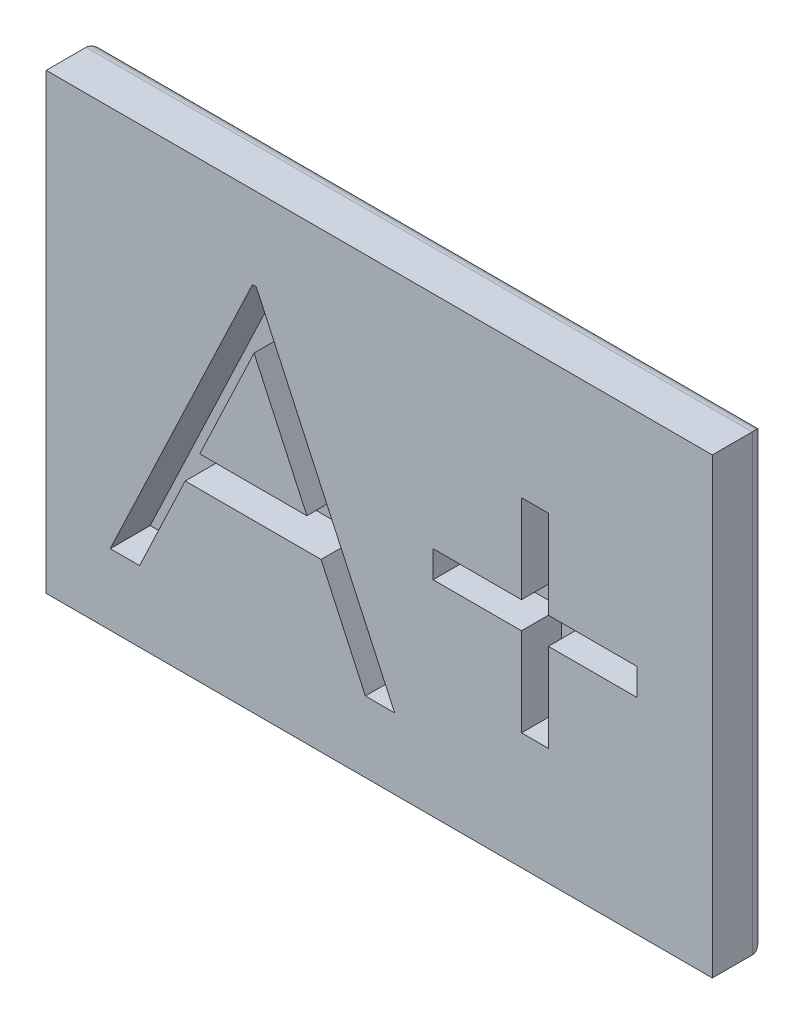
ISO-10303-21;
HEADER;
FILE_DESCRIPTION(('STEP AP214'),'2;1');
FILE_NAME('part.step','',(''),(''),'','','');
FILE_SCHEMA(('AUTOMOTIVE_DESIGN { 1 0 10303 214 1 1 1 1 }'));
ENDSEC;
DATA;
#1=APPLICATION_CONTEXT('core data for automotive mechanical design processes');
#2=APPLICATION_PROTOCOL_DEFINITION('international standard','automotive_design',2000,#1);
#3=PRODUCT_CONTEXT('',#1,'mechanical');
#4=PRODUCT('Part','Part','',(#3));
#5=PRODUCT_RELATED_PRODUCT_CATEGORY('part','',(#4));
#6=PRODUCT_DEFINITION_FORMATION('','',#4);
#7=PRODUCT_DEFINITION_CONTEXT('part definition',#1,'design');
#8=PRODUCT_DEFINITION('design','',#6,#7);
#9=PRODUCT_DEFINITION_SHAPE('','',#8);
#10=(LENGTH_UNIT() NAMED_UNIT(*) SI_UNIT(.MILLI.,.METRE.));
#11=(NAMED_UNIT(*) PLANE_ANGLE_UNIT() SI_UNIT($,.RADIAN.));
#12=(NAMED_UNIT(*) SI_UNIT($,.STERADIAN.) SOLID_ANGLE_UNIT());
#13=UNCERTAINTY_MEASURE_WITH_UNIT(LENGTH_MEASURE(1.E-05),#10,'distance_accuracy_value','');
#14=(GEOMETRIC_REPRESENTATION_CONTEXT(3) GLOBAL_UNCERTAINTY_ASSIGNED_CONTEXT((#13)) GLOBAL_UNIT_ASSIGNED_CONTEXT((#10,
#11,#12)) REPRESENTATION_CONTEXT('',''));
#15=CARTESIAN_POINT('',(0.,0.,0.));
#16=DIRECTION('',(0.,0.,1.));
#17=DIRECTION('',(1.,0.,0.));
#18=AXIS2_PLACEMENT_3D('',#15,#16,#17);
#19=CARTESIAN_POINT('',(0.,0.,2.54));
#20=DIRECTION('',(0.,0.,-1.));
#21=DIRECTION('',(-1.,0.,0.));
#22=AXIS2_PLACEMENT_3D('',#19,#20,#21);
#23=PLANE('',#22);
#24=DIRECTION('',(1.,0.,0.));
#25=VECTOR('',#24,1.);
#26=CARTESIAN_POINT('',(2.56442307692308,0.270538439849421,2.54));
#27=LINE('',#26,#25);
#28=CARTESIAN_POINT('',(2.56442307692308,0.270538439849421,2.54));
#29=VERTEX_POINT('',#28);
#30=CARTESIAN_POINT('',(6.77740384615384,0.270538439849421,2.54));
#31=VERTEX_POINT('',#30);
#32=EDGE_CURVE('E394',#29,#31,#27,.T.);
#33=ORIENTED_EDGE('',*,*,#32,.T.);
#34=DIRECTION('',(0.,1.,0.));
#35=VECTOR('',#34,1.);
#36=CARTESIAN_POINT('',(6.77740384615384,0.270538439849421,2.54));
#37=LINE('',#36,#35);
#38=CARTESIAN_POINT('',(6.77740384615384,4.48351920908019,2.54));
#39=VERTEX_POINT('',#38);
#40=EDGE_CURVE('E398',#31,#39,#37,.T.);
#41=ORIENTED_EDGE('',*,*,#40,.T.);
#42=DIRECTION('',(1.,0.,0.));
#43=VECTOR('',#42,1.);
#44=CARTESIAN_POINT('',(6.77740384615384,4.48351920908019,2.54));
#45=LINE('',#44,#43);
#46=CARTESIAN_POINT('',(8.05961538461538,4.48351920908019,2.54));
#47=VERTEX_POINT('',#46);
#48=EDGE_CURVE('E402',#39,#47,#45,.T.);
#49=ORIENTED_EDGE('',*,*,#48,.T.);
#50=DIRECTION('',(0.,-1.,0.));
#51=VECTOR('',#50,1.);
#52=CARTESIAN_POINT('',(8.05961538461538,4.48351920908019,2.54));
#53=LINE('',#52,#51);
#54=CARTESIAN_POINT('',(8.05961538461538,0.270538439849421,2.54));
#55=VERTEX_POINT('',#54);
#56=EDGE_CURVE('E406',#47,#55,#53,.T.);
#57=ORIENTED_EDGE('',*,*,#56,.T.);
#58=DIRECTION('',(1.,0.,0.));
#59=VECTOR('',#58,1.);
#60=CARTESIAN_POINT('',(8.05961538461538,0.270538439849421,2.54));
#61=LINE('',#60,#59);
#62=CARTESIAN_POINT('',(12.2725961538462,0.270538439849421,2.54));
#63=VERTEX_POINT('',#62);
#64=EDGE_CURVE('E410',#55,#63,#61,.T.);
#65=ORIENTED_EDGE('',*,*,#64,.T.);
#66=DIRECTION('',(0.,-1.,0.));
#67=VECTOR('',#66,1.);
#68=CARTESIAN_POINT('',(12.2725961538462,0.270538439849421,2.54));
#69=LINE('',#68,#67);
#70=CARTESIAN_POINT('',(12.2725961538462,-1.01167309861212,2.54));
#71=VERTEX_POINT('',#70);
#72=EDGE_CURVE('E414',#63,#71,#69,.T.);
#73=ORIENTED_EDGE('',*,*,#72,.T.);
#74=DIRECTION('',(-1.,0.,0.));
#75=VECTOR('',#74,1.);
#76=CARTESIAN_POINT('',(12.2725961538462,-1.01167309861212,2.54));
#77=LINE('',#76,#75);
#78=CARTESIAN_POINT('',(8.05961538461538,-1.01167309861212,2.54));
#79=VERTEX_POINT('',#78);
#80=EDGE_CURVE('E418',#71,#79,#77,.T.);
#81=ORIENTED_EDGE('',*,*,#80,.T.);
#82=DIRECTION('',(0.,-1.,0.));
#83=VECTOR('',#82,1.);
#84=CARTESIAN_POINT('',(8.05961538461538,-1.01167309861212,2.54));
#85=LINE('',#84,#83);
#86=CARTESIAN_POINT('',(8.05961538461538,-5.22465386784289,2.54));
#87=VERTEX_POINT('',#86);
#88=EDGE_CURVE('E422',#79,#87,#85,.T.);
#89=ORIENTED_EDGE('',*,*,#88,.T.);
#90=DIRECTION('',(-1.,0.,0.));
#91=VECTOR('',#90,1.);
#92=CARTESIAN_POINT('',(8.05961538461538,-5.22465386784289,2.54));
#93=LINE('',#92,#91);
#94=CARTESIAN_POINT('',(6.77740384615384,-5.22465386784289,2.54));
#95=VERTEX_POINT('',#94);
#96=EDGE_CURVE('E426',#87,#95,#93,.T.);
#97=ORIENTED_EDGE('',*,*,#96,.T.);
#98=DIRECTION('',(0.,1.,0.));
#99=VECTOR('',#98,1.);
#100=CARTESIAN_POINT('',(6.77740384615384,-5.22465386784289,2.54));
#101=LINE('',#100,#99);
#102=CARTESIAN_POINT('',(6.77740384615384,-1.01167309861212,2.54));
#103=VERTEX_POINT('',#102);
#104=EDGE_CURVE('E430',#95,#103,#101,.T.);
#105=ORIENTED_EDGE('',*,*,#104,.T.);
#106=DIRECTION('',(-1.,0.,0.));
#107=VECTOR('',#106,1.);
#108=CARTESIAN_POINT('',(6.77740384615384,-1.01167309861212,2.54));
#109=LINE('',#108,#107);
#110=CARTESIAN_POINT('',(2.56442307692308,-1.01167309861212,2.54));
#111=VERTEX_POINT('',#110);
#112=EDGE_CURVE('E434',#103,#111,#109,.T.);
#113=ORIENTED_EDGE('',*,*,#112,.T.);
#114=DIRECTION('',(0.,1.,0.));
#115=VECTOR('',#114,1.);
#116=CARTESIAN_POINT('',(2.56442307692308,-1.01167309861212,2.54));
#117=LINE('',#116,#115);
#118=EDGE_CURVE('E360',#111,#29,#117,.T.);
#119=ORIENTED_EDGE('',*,*,#118,.T.);
#120=EDGE_LOOP('',(#33,#41,#49,#57,#65,#73,#81,#89,#97,#105,#113,#119));
#121=FACE_BOUND('',#120,.T.);
#122=DIRECTION('',(0.,1.,0.));
#123=VECTOR('',#122,1.);
#124=CARTESIAN_POINT('',(15.875,-10.795,2.54));
#125=LINE('',#124,#123);
#126=CARTESIAN_POINT('',(15.875,-10.795,2.54));
#127=VERTEX_POINT('',#126);
#128=CARTESIAN_POINT('',(15.875,10.795,2.54));
#129=VERTEX_POINT('',#128);
#130=EDGE_CURVE('E477',#127,#129,#125,.T.);
#131=ORIENTED_EDGE('',*,*,#130,.T.);
#132=DIRECTION('',(-1.,0.,0.));
#133=VECTOR('',#132,1.);
#134=CARTESIAN_POINT('',(-15.875,10.795,2.54));
#135=LINE('',#134,#133);
#136=CARTESIAN_POINT('',(-15.875,10.795,2.54));
#137=VERTEX_POINT('',#136);
#138=EDGE_CURVE('E481',#129,#137,#135,.T.);
#139=ORIENTED_EDGE('',*,*,#138,.T.);
#140=DIRECTION('',(0.,-1.,0.));
#141=VECTOR('',#140,1.);
#142=CARTESIAN_POINT('',(-15.875,-10.795,2.54));
#143=LINE('',#142,#141);
#144=CARTESIAN_POINT('',(-15.875,-10.795,2.54));
#145=VERTEX_POINT('',#144);
#146=EDGE_CURVE('E484',#137,#145,#143,.T.);
#147=ORIENTED_EDGE('',*,*,#146,.T.);
#148=DIRECTION('',(1.,0.,0.));
#149=VECTOR('',#148,1.);
#150=CARTESIAN_POINT('',(-15.875,-10.795,2.54));
#151=LINE('',#150,#149);
#152=EDGE_CURVE('E487',#145,#127,#151,.T.);
#153=ORIENTED_EDGE('',*,*,#152,.T.);
#154=EDGE_LOOP('',(#131,#139,#147,#153));
#155=FACE_BOUND('',#154,.T.);
#156=DIRECTION('',(1.,0.,0.));
#157=VECTOR('',#156,1.);
#158=CARTESIAN_POINT('',(-6.04471153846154,6.86476920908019,2.54));
#159=LINE('',#158,#157);
#160=CARTESIAN_POINT('',(-6.04471153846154,6.86476920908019,2.54));
#161=VERTEX_POINT('',#160);
#162=CARTESIAN_POINT('',(-5.86153846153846,6.86476920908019,2.54));
#163=VERTEX_POINT('',#162);
#164=EDGE_CURVE('E56',#161,#163,#159,.T.);
#165=ORIENTED_EDGE('',*,*,#164,.T.);
#166=DIRECTION('',(0.419058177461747,-0.907959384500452,0.));
#167=VECTOR('',#166,1.);
#168=CARTESIAN_POINT('',(-5.86153846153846,6.86476920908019,2.54));
#169=LINE('',#168,#167);
#170=CARTESIAN_POINT('',(0.732692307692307,-7.42273079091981,2.54));
#171=VERTEX_POINT('',#170);
#172=EDGE_CURVE('E304',#163,#171,#169,.T.);
#173=ORIENTED_EDGE('',*,*,#172,.T.);
#174=DIRECTION('',(-1.,0.,0.));
#175=VECTOR('',#174,1.);
#176=CARTESIAN_POINT('',(0.732692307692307,-7.42273079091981,2.54));
#177=LINE('',#176,#175);
#178=CARTESIAN_POINT('',(-0.66114032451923,-7.42273079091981,2.54));
#179=VERTEX_POINT('',#178);
#180=EDGE_CURVE('E308',#171,#179,#177,.T.);
#181=ORIENTED_EDGE('',*,*,#180,.T.);
#182=DIRECTION('',(-0.418842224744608,0.908059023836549,0.));
#183=VECTOR('',#182,1.);
#184=CARTESIAN_POINT('',(-0.66114032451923,-7.42273079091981,2.54));
#185=LINE('',#184,#183);
#186=CARTESIAN_POINT('',(-2.77335486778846,-2.84340386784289,2.54));
#187=VERTEX_POINT('',#186);
#188=EDGE_CURVE('E312',#179,#187,#185,.T.);
#189=ORIENTED_EDGE('',*,*,#188,.T.);
#190=DIRECTION('',(-1.,0.,0.));
#191=VECTOR('',#190,1.);
#192=CARTESIAN_POINT('',(-2.77335486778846,-2.84340386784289,2.54));
#193=LINE('',#192,#191);
#194=CARTESIAN_POINT('',(-9.25024038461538,-2.84340386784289,2.54));
#195=VERTEX_POINT('',#194);
#196=EDGE_CURVE('E316',#187,#195,#193,.T.);
#197=ORIENTED_EDGE('',*,*,#196,.T.);
#198=DIRECTION('',(-0.428596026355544,-0.903496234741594,0.));
#199=VECTOR('',#198,1.);
#200=CARTESIAN_POINT('',(-9.25024038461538,-2.84340386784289,2.54));
#201=LINE('',#200,#199);
#202=CARTESIAN_POINT('',(-11.42255859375,-7.42273079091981,2.54));
#203=VERTEX_POINT('',#202);
#204=EDGE_CURVE('E320',#195,#203,#201,.T.);
#205=ORIENTED_EDGE('',*,*,#204,.T.);
#206=DIRECTION('',(-1.,0.,0.));
#207=VECTOR('',#206,1.);
#208=CARTESIAN_POINT('',(-11.42255859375,-7.42273079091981,2.54));
#209=LINE('',#208,#207);
#210=CARTESIAN_POINT('',(-12.8221153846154,-7.42273079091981,2.54));
#211=VERTEX_POINT('',#210);
#212=EDGE_CURVE('E324',#203,#211,#209,.T.);
#213=ORIENTED_EDGE('',*,*,#212,.T.);
#214=DIRECTION('',(0.428584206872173,0.903501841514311,0.));
#215=VECTOR('',#214,1.);
#216=CARTESIAN_POINT('',(-12.8221153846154,-7.42273079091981,2.54));
#217=LINE('',#216,#215);
#218=EDGE_CURVE('E280',#211,#161,#217,.T.);
#219=ORIENTED_EDGE('',*,*,#218,.T.);
#220=EDGE_LOOP('',(#165,#173,#181,#189,#197,#205,#213,#219));
#221=FACE_BOUND('',#220,.T.);
#222=ADVANCED_FACE('F38',(#121,#155,#221),#23,.F.);
#223=CARTESIAN_POINT('',(15.875,-10.795,2.54));
#224=DIRECTION('',(-1.,0.,0.));
#225=DIRECTION('',(0.,0.,1.));
#226=AXIS2_PLACEMENT_3D('',#223,#224,#225);
#227=PLANE('',#226);
#228=DIRECTION('',(0.,0.,-1.));
#229=VECTOR('',#228,1.);
#230=CARTESIAN_POINT('',(15.875,-10.795,2.54));
#231=LINE('',#230,#229);
#232=CARTESIAN_POINT('',(15.875,-10.795,0.635));
#233=VERTEX_POINT('',#232);
#234=EDGE_CURVE('E490',#127,#233,#231,.T.);
#235=ORIENTED_EDGE('',*,*,#234,.T.);
#236=DIRECTION('',(0.,1.,0.));
#237=VECTOR('',#236,1.);
#238=CARTESIAN_POINT('',(15.875,10.795,0.635));
#239=LINE('',#238,#237);
#240=CARTESIAN_POINT('',(15.875,10.795,0.635));
#241=VERTEX_POINT('',#240);
#242=EDGE_CURVE('E11',#233,#241,#239,.T.);
#243=ORIENTED_EDGE('',*,*,#242,.T.);
#244=DIRECTION('',(0.,0.,-1.));
#245=VECTOR('',#244,1.);
#246=CARTESIAN_POINT('',(15.875,10.795,2.54));
#247=LINE('',#246,#245);
#248=EDGE_CURVE('E502',#129,#241,#247,.T.);
#249=ORIENTED_EDGE('',*,*,#248,.F.);
#250=ORIENTED_EDGE('',*,*,#130,.F.);
#251=EDGE_LOOP('',(#235,#243,#249,#250));
#252=FACE_BOUND('',#251,.T.);
#253=ADVANCED_FACE('F574',(#252),#227,.F.);
#254=CARTESIAN_POINT('',(-15.875,10.795,2.54));
#255=DIRECTION('',(0.,-1.,0.));
#256=DIRECTION('',(0.,0.,-1.));
#257=AXIS2_PLACEMENT_3D('',#254,#255,#256);
#258=PLANE('',#257);
#259=ORIENTED_EDGE('',*,*,#248,.T.);
#260=DIRECTION('',(-1.,0.,0.));
#261=VECTOR('',#260,1.);
#262=CARTESIAN_POINT('',(-15.875,10.795,0.635));
#263=LINE('',#262,#261);
#264=CARTESIAN_POINT('',(-15.875,10.795,0.635));
#265=VERTEX_POINT('',#264);
#266=EDGE_CURVE('E48',#241,#265,#263,.T.);
#267=ORIENTED_EDGE('',*,*,#266,.T.);
#268=DIRECTION('',(0.,0.,-1.));
#269=VECTOR('',#268,1.);
#270=CARTESIAN_POINT('',(-15.875,10.795,2.54));
#271=LINE('',#270,#269);
#272=EDGE_CURVE('E498',#137,#265,#271,.T.);
#273=ORIENTED_EDGE('',*,*,#272,.F.);
#274=ORIENTED_EDGE('',*,*,#138,.F.);
#275=EDGE_LOOP('',(#259,#267,#273,#274));
#276=FACE_BOUND('',#275,.T.);
#277=ADVANCED_FACE('F572',(#276),#258,.F.);
#278=CARTESIAN_POINT('',(-15.875,-10.795,2.54));
#279=DIRECTION('',(1.,0.,0.));
#280=DIRECTION('',(0.,0.,-1.));
#281=AXIS2_PLACEMENT_3D('',#278,#279,#280);
#282=PLANE('',#281);
#283=ORIENTED_EDGE('',*,*,#272,.T.);
#284=DIRECTION('',(0.,-1.,0.));
#285=VECTOR('',#284,1.);
#286=CARTESIAN_POINT('',(-15.875,-10.795,0.635));
#287=LINE('',#286,#285);
#288=CARTESIAN_POINT('',(-15.875,-10.795,0.635));
#289=VERTEX_POINT('',#288);
#290=EDGE_CURVE('E506',#265,#289,#287,.T.);
#291=ORIENTED_EDGE('',*,*,#290,.T.);
#292=DIRECTION('',(0.,0.,-1.));
#293=VECTOR('',#292,1.);
#294=CARTESIAN_POINT('',(-15.875,-10.795,2.54));
#295=LINE('',#294,#293);
#296=EDGE_CURVE('E494',#145,#289,#295,.T.);
#297=ORIENTED_EDGE('',*,*,#296,.F.);
#298=ORIENTED_EDGE('',*,*,#146,.F.);
#299=EDGE_LOOP('',(#283,#291,#297,#298));
#300=FACE_BOUND('',#299,.T.);
#301=ADVANCED_FACE('F562',(#300),#282,.F.);
#302=CARTESIAN_POINT('',(-15.875,-10.795,2.54));
#303=DIRECTION('',(0.,1.,0.));
#304=DIRECTION('',(0.,0.,1.));
#305=AXIS2_PLACEMENT_3D('',#302,#303,#304);
#306=PLANE('',#305);
#307=ORIENTED_EDGE('',*,*,#296,.T.);
#308=DIRECTION('',(1.,0.,0.));
#309=VECTOR('',#308,1.);
#310=CARTESIAN_POINT('',(15.875,-10.795,0.635));
#311=LINE('',#310,#309);
#312=EDGE_CURVE('E523',#289,#233,#311,.T.);
#313=ORIENTED_EDGE('',*,*,#312,.T.);
#314=ORIENTED_EDGE('',*,*,#234,.F.);
#315=ORIENTED_EDGE('',*,*,#152,.F.);
#316=EDGE_LOOP('',(#307,#313,#314,#315));
#317=FACE_BOUND('',#316,.T.);
#318=ADVANCED_FACE('F566',(#317),#306,.F.);
#319=CARTESIAN_POINT('',(0.,0.,0.));
#320=DIRECTION('',(0.,0.,-1.));
#321=DIRECTION('',(-1.,0.,0.));
#322=AXIS2_PLACEMENT_3D('',#319,#320,#321);
#323=PLANE('',#322);
#324=DIRECTION('',(1.,0.,0.));
#325=VECTOR('',#324,1.);
#326=CARTESIAN_POINT('',(-15.875,-10.16,0.));
#327=LINE('',#326,#325);
#328=CARTESIAN_POINT('',(15.24,-10.16,0.));
#329=VERTEX_POINT('',#328);
#330=CARTESIAN_POINT('',(-15.24,-10.16,0.));
#331=VERTEX_POINT('',#330);
#332=EDGE_CURVE('E516',#329,#331,#327,.F.);
#333=ORIENTED_EDGE('',*,*,#332,.T.);
#334=DIRECTION('',(0.,-1.,0.));
#335=VECTOR('',#334,1.);
#336=CARTESIAN_POINT('',(-15.24,10.795,0.));
#337=LINE('',#336,#335);
#338=CARTESIAN_POINT('',(-15.24,10.16,0.));
#339=VERTEX_POINT('',#338);
#340=EDGE_CURVE('E519',#331,#339,#337,.F.);
#341=ORIENTED_EDGE('',*,*,#340,.T.);
#342=DIRECTION('',(-1.,0.,0.));
#343=VECTOR('',#342,1.);
#344=CARTESIAN_POINT('',(15.875,10.16,0.));
#345=LINE('',#344,#343);
#346=CARTESIAN_POINT('',(15.24,10.16,0.));
#347=VERTEX_POINT('',#346);
#348=EDGE_CURVE('E513',#339,#347,#345,.F.);
#349=ORIENTED_EDGE('',*,*,#348,.T.);
#350=DIRECTION('',(0.,1.,0.));
#351=VECTOR('',#350,1.);
#352=CARTESIAN_POINT('',(15.24,-10.795,0.));
#353=LINE('',#352,#351);
#354=EDGE_CURVE('E510',#347,#329,#353,.F.);
#355=ORIENTED_EDGE('',*,*,#354,.T.);
#356=EDGE_LOOP('',(#333,#341,#349,#355));
#357=FACE_BOUND('',#356,.T.);
#358=ADVANCED_FACE('F551',(#357),#323,.T.);
#359=CARTESIAN_POINT('',(15.24,-10.795,0.635));
#360=DIRECTION('',(0.,-1.,0.));
#361=DIRECTION('',(0.,0.,-1.));
#362=AXIS2_PLACEMENT_3D('',#359,#360,#361);
#363=CYLINDRICAL_SURFACE('',#362,0.635);
#364=CARTESIAN_POINT('',(15.24,-10.16,0.635));
#365=DIRECTION('',(-0.707106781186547,-0.707106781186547,0.));
#366=DIRECTION('',(0.707106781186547,-0.707106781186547,0.));
#367=AXIS2_PLACEMENT_3D('',#364,#365,#366);
#368=ELLIPSE('',#367,0.898025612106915,0.635);
#369=EDGE_CURVE('E532',#329,#233,#368,.T.);
#370=ORIENTED_EDGE('',*,*,#369,.F.);
#371=ORIENTED_EDGE('',*,*,#354,.F.);
#372=CARTESIAN_POINT('',(15.24,10.16,0.635));
#373=DIRECTION('',(0.707106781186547,-0.707106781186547,0.));
#374=DIRECTION('',(-0.707106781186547,-0.707106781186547,0.));
#375=AXIS2_PLACEMENT_3D('',#372,#373,#374);
#376=ELLIPSE('',#375,0.898025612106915,0.635);
#377=EDGE_CURVE('E42',#241,#347,#376,.F.);
#378=ORIENTED_EDGE('',*,*,#377,.F.);
#379=ORIENTED_EDGE('',*,*,#242,.F.);
#380=EDGE_LOOP('',(#370,#371,#378,#379));
#381=FACE_BOUND('',#380,.T.);
#382=ADVANCED_FACE('F40',(#381),#363,.T.);
#383=CARTESIAN_POINT('',(-15.875,10.16,0.635));
#384=DIRECTION('',(1.,0.,0.));
#385=DIRECTION('',(0.,0.,-1.));
#386=AXIS2_PLACEMENT_3D('',#383,#384,#385);
#387=CYLINDRICAL_SURFACE('',#386,0.635);
#388=ORIENTED_EDGE('',*,*,#377,.T.);
#389=ORIENTED_EDGE('',*,*,#348,.F.);
#390=CARTESIAN_POINT('',(-15.24,10.16,0.635));
#391=DIRECTION('',(0.707106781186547,0.707106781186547,0.));
#392=DIRECTION('',(0.707106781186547,-0.707106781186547,0.));
#393=AXIS2_PLACEMENT_3D('',#390,#391,#392);
#394=ELLIPSE('',#393,0.898025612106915,0.635);
#395=EDGE_CURVE('E530',#265,#339,#394,.F.);
#396=ORIENTED_EDGE('',*,*,#395,.F.);
#397=ORIENTED_EDGE('',*,*,#266,.F.);
#398=EDGE_LOOP('',(#388,#389,#396,#397));
#399=FACE_BOUND('',#398,.T.);
#400=ADVANCED_FACE('F545',(#399),#387,.T.);
#401=CARTESIAN_POINT('',(-15.875,-10.16,0.635));
#402=DIRECTION('',(-1.,0.,0.));
#403=DIRECTION('',(0.,0.,1.));
#404=AXIS2_PLACEMENT_3D('',#401,#402,#403);
#405=CYLINDRICAL_SURFACE('',#404,0.635);
#406=ORIENTED_EDGE('',*,*,#369,.T.);
#407=ORIENTED_EDGE('',*,*,#312,.F.);
#408=CARTESIAN_POINT('',(-15.24,-10.16,0.635));
#409=DIRECTION('',(-0.707106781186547,0.707106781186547,0.));
#410=DIRECTION('',(-0.707106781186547,-0.707106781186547,0.));
#411=AXIS2_PLACEMENT_3D('',#408,#409,#410);
#412=ELLIPSE('',#411,0.898025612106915,0.635);
#413=EDGE_CURVE('E354',#331,#289,#412,.T.);
#414=ORIENTED_EDGE('',*,*,#413,.F.);
#415=ORIENTED_EDGE('',*,*,#332,.F.);
#416=EDGE_LOOP('',(#406,#407,#414,#415));
#417=FACE_BOUND('',#416,.T.);
#418=ADVANCED_FACE('F557',(#417),#405,.T.);
#419=CARTESIAN_POINT('',(-15.24,-10.795,0.635));
#420=DIRECTION('',(0.,1.,0.));
#421=DIRECTION('',(0.,0.,1.));
#422=AXIS2_PLACEMENT_3D('',#419,#420,#421);
#423=CYLINDRICAL_SURFACE('',#422,0.635);
#424=ORIENTED_EDGE('',*,*,#395,.T.);
#425=ORIENTED_EDGE('',*,*,#340,.F.);
#426=ORIENTED_EDGE('',*,*,#413,.T.);
#427=ORIENTED_EDGE('',*,*,#290,.F.);
#428=EDGE_LOOP('',(#424,#425,#426,#427));
#429=FACE_BOUND('',#428,.T.);
#430=ADVANCED_FACE('F555',(#429),#423,.T.);
#431=CARTESIAN_POINT('',(2.56442307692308,0.270538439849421,0.635));
#432=DIRECTION('',(0.,-1.,0.));
#433=DIRECTION('',(0.,0.,-1.));
#434=AXIS2_PLACEMENT_3D('',#431,#432,#433);
#435=PLANE('',#434);
#436=ORIENTED_EDGE('',*,*,#32,.F.);
#437=DIRECTION('',(0.,0.,1.));
#438=VECTOR('',#437,1.);
#439=CARTESIAN_POINT('',(2.56442307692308,0.270538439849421,0.635));
#440=LINE('',#439,#438);
#441=CARTESIAN_POINT('',(2.56442307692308,0.270538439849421,0.635));
#442=VERTEX_POINT('',#441);
#443=EDGE_CURVE('E393',#442,#29,#440,.T.);
#444=ORIENTED_EDGE('',*,*,#443,.F.);
#445=DIRECTION('',(1.,0.,0.));
#446=VECTOR('',#445,1.);
#447=CARTESIAN_POINT('',(2.56442307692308,0.270538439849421,0.635));
#448=LINE('',#447,#446);
#449=CARTESIAN_POINT('',(6.77740384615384,0.270538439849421,0.635));
#450=VERTEX_POINT('',#449);
#451=EDGE_CURVE('E355',#442,#450,#448,.T.);
#452=ORIENTED_EDGE('',*,*,#451,.T.);
#453=DIRECTION('',(0.,0.,1.));
#454=VECTOR('',#453,1.);
#455=CARTESIAN_POINT('',(6.77740384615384,0.270538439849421,0.635));
#456=LINE('',#455,#454);
#457=EDGE_CURVE('E268',#450,#31,#456,.T.);
#458=ORIENTED_EDGE('',*,*,#457,.T.);
#459=EDGE_LOOP('',(#436,#444,#452,#458));
#460=FACE_BOUND('',#459,.T.);
#461=ADVANCED_FACE('F589',(#460),#435,.T.);
#462=CARTESIAN_POINT('',(6.77740384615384,0.270538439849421,0.635));
#463=DIRECTION('',(1.,0.,0.));
#464=DIRECTION('',(0.,0.,-1.));
#465=AXIS2_PLACEMENT_3D('',#462,#463,#464);
#466=PLANE('',#465);
#467=ORIENTED_EDGE('',*,*,#40,.F.);
#468=ORIENTED_EDGE('',*,*,#457,.F.);
#469=DIRECTION('',(0.,1.,0.));
#470=VECTOR('',#469,1.);
#471=CARTESIAN_POINT('',(6.77740384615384,0.270538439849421,0.635));
#472=LINE('',#471,#470);
#473=CARTESIAN_POINT('',(6.77740384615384,4.48351920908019,0.635));
#474=VERTEX_POINT('',#473);
#475=EDGE_CURVE('E359',#450,#474,#472,.T.);
#476=ORIENTED_EDGE('',*,*,#475,.T.);
#477=DIRECTION('',(0.,0.,1.));
#478=VECTOR('',#477,1.);
#479=CARTESIAN_POINT('',(6.77740384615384,4.48351920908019,0.635));
#480=LINE('',#479,#478);
#481=EDGE_CURVE('E471',#474,#39,#480,.T.);
#482=ORIENTED_EDGE('',*,*,#481,.T.);
#483=EDGE_LOOP('',(#467,#468,#476,#482));
#484=FACE_BOUND('',#483,.T.);
#485=ADVANCED_FACE('F652',(#484),#466,.T.);
#486=CARTESIAN_POINT('',(6.77740384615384,4.48351920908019,0.635));
#487=DIRECTION('',(0.,-1.,0.));
#488=DIRECTION('',(0.,0.,-1.));
#489=AXIS2_PLACEMENT_3D('',#486,#487,#488);
#490=PLANE('',#489);
#491=ORIENTED_EDGE('',*,*,#48,.F.);
#492=ORIENTED_EDGE('',*,*,#481,.F.);
#493=DIRECTION('',(1.,0.,0.));
#494=VECTOR('',#493,1.);
#495=CARTESIAN_POINT('',(6.77740384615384,4.48351920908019,0.635));
#496=LINE('',#495,#494);
#497=CARTESIAN_POINT('',(8.05961538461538,4.48351920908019,0.635));
#498=VERTEX_POINT('',#497);
#499=EDGE_CURVE('E363',#474,#498,#496,.T.);
#500=ORIENTED_EDGE('',*,*,#499,.T.);
#501=DIRECTION('',(0.,0.,1.));
#502=VECTOR('',#501,1.);
#503=CARTESIAN_POINT('',(8.05961538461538,4.48351920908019,0.635));
#504=LINE('',#503,#502);
#505=EDGE_CURVE('E468',#498,#47,#504,.T.);
#506=ORIENTED_EDGE('',*,*,#505,.T.);
#507=EDGE_LOOP('',(#491,#492,#500,#506));
#508=FACE_BOUND('',#507,.T.);
#509=ADVANCED_FACE('F661',(#508),#490,.T.);
#510=CARTESIAN_POINT('',(8.05961538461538,4.48351920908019,0.635));
#511=DIRECTION('',(-1.,0.,0.));
#512=DIRECTION('',(0.,0.,1.));
#513=AXIS2_PLACEMENT_3D('',#510,#511,#512);
#514=PLANE('',#513);
#515=ORIENTED_EDGE('',*,*,#56,.F.);
#516=ORIENTED_EDGE('',*,*,#505,.F.);
#517=DIRECTION('',(0.,-1.,0.));
#518=VECTOR('',#517,1.);
#519=CARTESIAN_POINT('',(8.05961538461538,4.48351920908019,0.635));
#520=LINE('',#519,#518);
#521=CARTESIAN_POINT('',(8.05961538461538,0.270538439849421,0.635));
#522=VERTEX_POINT('',#521);
#523=EDGE_CURVE('E366',#498,#522,#520,.T.);
#524=ORIENTED_EDGE('',*,*,#523,.T.);
#525=DIRECTION('',(0.,0.,1.));
#526=VECTOR('',#525,1.);
#527=CARTESIAN_POINT('',(8.05961538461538,0.270538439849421,0.635));
#528=LINE('',#527,#526);
#529=EDGE_CURVE('E465',#522,#55,#528,.T.);
#530=ORIENTED_EDGE('',*,*,#529,.T.);
#531=EDGE_LOOP('',(#515,#516,#524,#530));
#532=FACE_BOUND('',#531,.T.);
#533=ADVANCED_FACE('F671',(#532),#514,.T.);
#534=CARTESIAN_POINT('',(8.05961538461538,0.270538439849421,0.635));
#535=DIRECTION('',(0.,-1.,0.));
#536=DIRECTION('',(0.,0.,-1.));
#537=AXIS2_PLACEMENT_3D('',#534,#535,#536);
#538=PLANE('',#537);
#539=ORIENTED_EDGE('',*,*,#64,.F.);
#540=ORIENTED_EDGE('',*,*,#529,.F.);
#541=DIRECTION('',(1.,0.,0.));
#542=VECTOR('',#541,1.);
#543=CARTESIAN_POINT('',(8.05961538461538,0.270538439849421,0.635));
#544=LINE('',#543,#542);
#545=CARTESIAN_POINT('',(12.2725961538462,0.270538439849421,0.635));
#546=VERTEX_POINT('',#545);
#547=EDGE_CURVE('E369',#522,#546,#544,.T.);
#548=ORIENTED_EDGE('',*,*,#547,.T.);
#549=DIRECTION('',(0.,0.,1.));
#550=VECTOR('',#549,1.);
#551=CARTESIAN_POINT('',(12.2725961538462,0.270538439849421,0.635));
#552=LINE('',#551,#550);
#553=EDGE_CURVE('E462',#546,#63,#552,.T.);
#554=ORIENTED_EDGE('',*,*,#553,.T.);
#555=EDGE_LOOP('',(#539,#540,#548,#554));
#556=FACE_BOUND('',#555,.T.);
#557=ADVANCED_FACE('F681',(#556),#538,.T.);
#558=CARTESIAN_POINT('',(12.2725961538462,0.270538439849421,0.635));
#559=DIRECTION('',(-1.,0.,0.));
#560=DIRECTION('',(0.,0.,1.));
#561=AXIS2_PLACEMENT_3D('',#558,#559,#560);
#562=PLANE('',#561);
#563=ORIENTED_EDGE('',*,*,#72,.F.);
#564=ORIENTED_EDGE('',*,*,#553,.F.);
#565=DIRECTION('',(0.,-1.,0.));
#566=VECTOR('',#565,1.);
#567=CARTESIAN_POINT('',(12.2725961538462,0.270538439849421,0.635));
#568=LINE('',#567,#566);
#569=CARTESIAN_POINT('',(12.2725961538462,-1.01167309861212,0.635));
#570=VERTEX_POINT('',#569);
#571=EDGE_CURVE('E372',#546,#570,#568,.T.);
#572=ORIENTED_EDGE('',*,*,#571,.T.);
#573=DIRECTION('',(0.,0.,1.));
#574=VECTOR('',#573,1.);
#575=CARTESIAN_POINT('',(12.2725961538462,-1.01167309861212,0.635));
#576=LINE('',#575,#574);
#577=EDGE_CURVE('E459',#570,#71,#576,.T.);
#578=ORIENTED_EDGE('',*,*,#577,.T.);
#579=EDGE_LOOP('',(#563,#564,#572,#578));
#580=FACE_BOUND('',#579,.T.);
#581=ADVANCED_FACE('F691',(#580),#562,.T.);
#582=CARTESIAN_POINT('',(12.2725961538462,-1.01167309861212,0.635));
#583=DIRECTION('',(0.,1.,0.));
#584=DIRECTION('',(0.,0.,1.));
#585=AXIS2_PLACEMENT_3D('',#582,#583,#584);
#586=PLANE('',#585);
#587=ORIENTED_EDGE('',*,*,#80,.F.);
#588=ORIENTED_EDGE('',*,*,#577,.F.);
#589=DIRECTION('',(-1.,0.,0.));
#590=VECTOR('',#589,1.);
#591=CARTESIAN_POINT('',(12.2725961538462,-1.01167309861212,0.635));
#592=LINE('',#591,#590);
#593=CARTESIAN_POINT('',(8.05961538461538,-1.01167309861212,0.635));
#594=VERTEX_POINT('',#593);
#595=EDGE_CURVE('E375',#570,#594,#592,.T.);
#596=ORIENTED_EDGE('',*,*,#595,.T.);
#597=DIRECTION('',(0.,0.,1.));
#598=VECTOR('',#597,1.);
#599=CARTESIAN_POINT('',(8.05961538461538,-1.01167309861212,0.635));
#600=LINE('',#599,#598);
#601=EDGE_CURVE('E456',#594,#79,#600,.T.);
#602=ORIENTED_EDGE('',*,*,#601,.T.);
#603=EDGE_LOOP('',(#587,#588,#596,#602));
#604=FACE_BOUND('',#603,.T.);
#605=ADVANCED_FACE('F701',(#604),#586,.T.);
#606=CARTESIAN_POINT('',(8.05961538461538,-1.01167309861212,0.635));
#607=DIRECTION('',(-1.,0.,0.));
#608=DIRECTION('',(0.,0.,1.));
#609=AXIS2_PLACEMENT_3D('',#606,#607,#608);
#610=PLANE('',#609);
#611=ORIENTED_EDGE('',*,*,#88,.F.);
#612=ORIENTED_EDGE('',*,*,#601,.F.);
#613=DIRECTION('',(0.,-1.,0.));
#614=VECTOR('',#613,1.);
#615=CARTESIAN_POINT('',(8.05961538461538,-1.01167309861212,0.635));
#616=LINE('',#615,#614);
#617=CARTESIAN_POINT('',(8.05961538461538,-5.22465386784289,0.635));
#618=VERTEX_POINT('',#617);
#619=EDGE_CURVE('E378',#594,#618,#616,.T.);
#620=ORIENTED_EDGE('',*,*,#619,.T.);
#621=DIRECTION('',(0.,0.,1.));
#622=VECTOR('',#621,1.);
#623=CARTESIAN_POINT('',(8.05961538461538,-5.22465386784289,0.635));
#624=LINE('',#623,#622);
#625=EDGE_CURVE('E453',#618,#87,#624,.T.);
#626=ORIENTED_EDGE('',*,*,#625,.T.);
#627=EDGE_LOOP('',(#611,#612,#620,#626));
#628=FACE_BOUND('',#627,.T.);
#629=ADVANCED_FACE('F711',(#628),#610,.T.);
#630=CARTESIAN_POINT('',(8.05961538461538,-5.22465386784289,0.635));
#631=DIRECTION('',(0.,1.,0.));
#632=DIRECTION('',(0.,0.,1.));
#633=AXIS2_PLACEMENT_3D('',#630,#631,#632);
#634=PLANE('',#633);
#635=ORIENTED_EDGE('',*,*,#96,.F.);
#636=ORIENTED_EDGE('',*,*,#625,.F.);
#637=DIRECTION('',(-1.,0.,0.));
#638=VECTOR('',#637,1.);
#639=CARTESIAN_POINT('',(8.05961538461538,-5.22465386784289,0.635));
#640=LINE('',#639,#638);
#641=CARTESIAN_POINT('',(6.77740384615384,-5.22465386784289,0.635));
#642=VERTEX_POINT('',#641);
#643=EDGE_CURVE('E381',#618,#642,#640,.T.);
#644=ORIENTED_EDGE('',*,*,#643,.T.);
#645=DIRECTION('',(0.,0.,1.));
#646=VECTOR('',#645,1.);
#647=CARTESIAN_POINT('',(6.77740384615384,-5.22465386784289,0.635));
#648=LINE('',#647,#646);
#649=EDGE_CURVE('E450',#642,#95,#648,.T.);
#650=ORIENTED_EDGE('',*,*,#649,.T.);
#651=EDGE_LOOP('',(#635,#636,#644,#650));
#652=FACE_BOUND('',#651,.T.);
#653=ADVANCED_FACE('F721',(#652),#634,.T.);
#654=CARTESIAN_POINT('',(6.77740384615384,-5.22465386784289,0.635));
#655=DIRECTION('',(1.,0.,0.));
#656=DIRECTION('',(0.,0.,-1.));
#657=AXIS2_PLACEMENT_3D('',#654,#655,#656);
#658=PLANE('',#657);
#659=ORIENTED_EDGE('',*,*,#104,.F.);
#660=ORIENTED_EDGE('',*,*,#649,.F.);
#661=DIRECTION('',(0.,1.,0.));
#662=VECTOR('',#661,1.);
#663=CARTESIAN_POINT('',(6.77740384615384,-5.22465386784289,0.635));
#664=LINE('',#663,#662);
#665=CARTESIAN_POINT('',(6.77740384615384,-1.01167309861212,0.635));
#666=VERTEX_POINT('',#665);
#667=EDGE_CURVE('E384',#642,#666,#664,.T.);
#668=ORIENTED_EDGE('',*,*,#667,.T.);
#669=DIRECTION('',(0.,0.,1.));
#670=VECTOR('',#669,1.);
#671=CARTESIAN_POINT('',(6.77740384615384,-1.01167309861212,0.635));
#672=LINE('',#671,#670);
#673=EDGE_CURVE('E447',#666,#103,#672,.T.);
#674=ORIENTED_EDGE('',*,*,#673,.T.);
#675=EDGE_LOOP('',(#659,#660,#668,#674));
#676=FACE_BOUND('',#675,.T.);
#677=ADVANCED_FACE('F731',(#676),#658,.T.);
#678=CARTESIAN_POINT('',(6.77740384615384,-1.01167309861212,0.635));
#679=DIRECTION('',(0.,1.,0.));
#680=DIRECTION('',(0.,0.,1.));
#681=AXIS2_PLACEMENT_3D('',#678,#679,#680);
#682=PLANE('',#681);
#683=ORIENTED_EDGE('',*,*,#112,.F.);
#684=ORIENTED_EDGE('',*,*,#673,.F.);
#685=DIRECTION('',(-1.,0.,0.));
#686=VECTOR('',#685,1.);
#687=CARTESIAN_POINT('',(6.77740384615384,-1.01167309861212,0.635));
#688=LINE('',#687,#686);
#689=CARTESIAN_POINT('',(2.56442307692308,-1.01167309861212,0.635));
#690=VERTEX_POINT('',#689);
#691=EDGE_CURVE('E387',#666,#690,#688,.T.);
#692=ORIENTED_EDGE('',*,*,#691,.T.);
#693=DIRECTION('',(0.,0.,1.));
#694=VECTOR('',#693,1.);
#695=CARTESIAN_POINT('',(2.56442307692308,-1.01167309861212,0.635));
#696=LINE('',#695,#694);
#697=EDGE_CURVE('E444',#690,#111,#696,.T.);
#698=ORIENTED_EDGE('',*,*,#697,.T.);
#699=EDGE_LOOP('',(#683,#684,#692,#698));
#700=FACE_BOUND('',#699,.T.);
#701=ADVANCED_FACE('F741',(#700),#682,.T.);
#702=CARTESIAN_POINT('',(2.56442307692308,-1.01167309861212,0.635));
#703=DIRECTION('',(1.,0.,0.));
#704=DIRECTION('',(0.,0.,-1.));
#705=AXIS2_PLACEMENT_3D('',#702,#703,#704);
#706=PLANE('',#705);
#707=ORIENTED_EDGE('',*,*,#118,.F.);
#708=ORIENTED_EDGE('',*,*,#697,.F.);
#709=DIRECTION('',(0.,1.,0.));
#710=VECTOR('',#709,1.);
#711=CARTESIAN_POINT('',(2.56442307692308,-1.01167309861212,0.635));
#712=LINE('',#711,#710);
#713=EDGE_CURVE('E390',#690,#442,#712,.T.);
#714=ORIENTED_EDGE('',*,*,#713,.T.);
#715=ORIENTED_EDGE('',*,*,#443,.T.);
#716=EDGE_LOOP('',(#707,#708,#714,#715));
#717=FACE_BOUND('',#716,.T.);
#718=ADVANCED_FACE('F751',(#717),#706,.T.);
#719=CARTESIAN_POINT('',(0.,0.,0.635));
#720=DIRECTION('',(0.,0.,1.));
#721=DIRECTION('',(1.,0.,0.));
#722=AXIS2_PLACEMENT_3D('',#719,#720,#721);
#723=PLANE('',#722);
#724=ORIENTED_EDGE('',*,*,#451,.F.);
#725=ORIENTED_EDGE('',*,*,#713,.F.);
#726=ORIENTED_EDGE('',*,*,#691,.F.);
#727=ORIENTED_EDGE('',*,*,#667,.F.);
#728=ORIENTED_EDGE('',*,*,#643,.F.);
#729=ORIENTED_EDGE('',*,*,#619,.F.);
#730=ORIENTED_EDGE('',*,*,#595,.F.);
#731=ORIENTED_EDGE('',*,*,#571,.F.);
#732=ORIENTED_EDGE('',*,*,#547,.F.);
#733=ORIENTED_EDGE('',*,*,#523,.F.);
#734=ORIENTED_EDGE('',*,*,#499,.F.);
#735=ORIENTED_EDGE('',*,*,#475,.F.);
#736=EDGE_LOOP('',(#724,#725,#726,#727,#728,#729,#730,#731,#732,#733,#734,#735));
#737=FACE_BOUND('',#736,.T.);
#738=ADVANCED_FACE('F761',(#737),#723,.T.);
#739=CARTESIAN_POINT('',(-6.04471153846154,6.86476920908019,0.635));
#740=DIRECTION('',(0.,-1.,0.));
#741=DIRECTION('',(0.,0.,-1.));
#742=AXIS2_PLACEMENT_3D('',#739,#740,#741);
#743=PLANE('',#742);
#744=ORIENTED_EDGE('',*,*,#164,.F.);
#745=DIRECTION('',(0.,0.,1.));
#746=VECTOR('',#745,1.);
#747=CARTESIAN_POINT('',(-6.04471153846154,6.86476920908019,0.635));
#748=LINE('',#747,#746);
#749=CARTESIAN_POINT('',(-6.04471153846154,6.86476920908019,0.635));
#750=VERTEX_POINT('',#749);
#751=EDGE_CURVE('E301',#750,#161,#748,.T.);
#752=ORIENTED_EDGE('',*,*,#751,.F.);
#753=DIRECTION('',(1.,0.,0.));
#754=VECTOR('',#753,1.);
#755=CARTESIAN_POINT('',(-6.04471153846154,6.86476920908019,0.635));
#756=LINE('',#755,#754);
#757=CARTESIAN_POINT('',(-5.86153846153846,6.86476920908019,0.635));
#758=VERTEX_POINT('',#757);
#759=EDGE_CURVE('E275',#750,#758,#756,.T.);
#760=ORIENTED_EDGE('',*,*,#759,.T.);
#761=DIRECTION('',(0.,0.,1.));
#762=VECTOR('',#761,1.);
#763=CARTESIAN_POINT('',(-5.86153846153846,6.86476920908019,0.635));
#764=LINE('',#763,#762);
#765=EDGE_CURVE('E351',#758,#163,#764,.T.);
#766=ORIENTED_EDGE('',*,*,#765,.T.);
#767=EDGE_LOOP('',(#744,#752,#760,#766));
#768=FACE_BOUND('',#767,.T.);
#769=ADVANCED_FACE('F772',(#768),#743,.T.);
#770=CARTESIAN_POINT('',(-5.86153846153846,6.86476920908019,0.635));
#771=DIRECTION('',(-0.907959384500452,-0.419058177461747,0.));
#772=DIRECTION('',(0.419058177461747,-0.907959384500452,0.));
#773=AXIS2_PLACEMENT_3D('',#770,#771,#772);
#774=PLANE('',#773);
#775=ORIENTED_EDGE('',*,*,#172,.F.);
#776=ORIENTED_EDGE('',*,*,#765,.F.);
#777=DIRECTION('',(0.419058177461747,-0.907959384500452,0.));
#778=VECTOR('',#777,1.);
#779=CARTESIAN_POINT('',(-5.86153846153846,6.86476920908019,0.635));
#780=LINE('',#779,#778);
#781=CARTESIAN_POINT('',(0.732692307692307,-7.42273079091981,0.635));
#782=VERTEX_POINT('',#781);
#783=EDGE_CURVE('E279',#758,#782,#780,.T.);
#784=ORIENTED_EDGE('',*,*,#783,.T.);
#785=DIRECTION('',(0.,0.,1.));
#786=VECTOR('',#785,1.);
#787=CARTESIAN_POINT('',(0.732692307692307,-7.42273079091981,0.635));
#788=LINE('',#787,#786);
#789=EDGE_CURVE('E348',#782,#171,#788,.T.);
#790=ORIENTED_EDGE('',*,*,#789,.T.);
#791=EDGE_LOOP('',(#775,#776,#784,#790));
#792=FACE_BOUND('',#791,.T.);
#793=ADVANCED_FACE('F783',(#792),#774,.T.);
#794=CARTESIAN_POINT('',(0.732692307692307,-7.42273079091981,0.635));
#795=DIRECTION('',(0.,1.,0.));
#796=DIRECTION('',(0.,0.,1.));
#797=AXIS2_PLACEMENT_3D('',#794,#795,#796);
#798=PLANE('',#797);
#799=ORIENTED_EDGE('',*,*,#180,.F.);
#800=ORIENTED_EDGE('',*,*,#789,.F.);
#801=DIRECTION('',(-1.,0.,0.));
#802=VECTOR('',#801,1.);
#803=CARTESIAN_POINT('',(0.732692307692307,-7.42273079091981,0.635));
#804=LINE('',#803,#802);
#805=CARTESIAN_POINT('',(-0.66114032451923,-7.42273079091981,0.635));
#806=VERTEX_POINT('',#805);
#807=EDGE_CURVE('E283',#782,#806,#804,.T.);
#808=ORIENTED_EDGE('',*,*,#807,.T.);
#809=DIRECTION('',(0.,0.,1.));
#810=VECTOR('',#809,1.);
#811=CARTESIAN_POINT('',(-0.66114032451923,-7.42273079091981,0.635));
#812=LINE('',#811,#810);
#813=EDGE_CURVE('E345',#806,#179,#812,.T.);
#814=ORIENTED_EDGE('',*,*,#813,.T.);
#815=EDGE_LOOP('',(#799,#800,#808,#814));
#816=FACE_BOUND('',#815,.T.);
#817=ADVANCED_FACE('F792',(#816),#798,.T.);
#818=CARTESIAN_POINT('',(-0.66114032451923,-7.42273079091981,0.635));
#819=DIRECTION('',(0.908059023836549,0.418842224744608,0.));
#820=DIRECTION('',(-0.418842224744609,0.908059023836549,0.));
#821=AXIS2_PLACEMENT_3D('',#818,#819,#820);
#822=PLANE('',#821);
#823=ORIENTED_EDGE('',*,*,#188,.F.);
#824=ORIENTED_EDGE('',*,*,#813,.F.);
#825=DIRECTION('',(-0.418842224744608,0.908059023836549,0.));
#826=VECTOR('',#825,1.);
#827=CARTESIAN_POINT('',(-0.66114032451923,-7.42273079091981,0.635));
#828=LINE('',#827,#826);
#829=CARTESIAN_POINT('',(-2.77335486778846,-2.84340386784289,0.635));
#830=VERTEX_POINT('',#829);
#831=EDGE_CURVE('E286',#806,#830,#828,.T.);
#832=ORIENTED_EDGE('',*,*,#831,.T.);
#833=DIRECTION('',(0.,0.,1.));
#834=VECTOR('',#833,1.);
#835=CARTESIAN_POINT('',(-2.77335486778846,-2.84340386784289,0.635));
#836=LINE('',#835,#834);
#837=EDGE_CURVE('E342',#830,#187,#836,.T.);
#838=ORIENTED_EDGE('',*,*,#837,.T.);
#839=EDGE_LOOP('',(#823,#824,#832,#838));
#840=FACE_BOUND('',#839,.T.);
#841=ADVANCED_FACE('F802',(#840),#822,.T.);
#842=CARTESIAN_POINT('',(-2.77335486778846,-2.84340386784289,0.635));
#843=DIRECTION('',(0.,1.,0.));
#844=DIRECTION('',(0.,0.,1.));
#845=AXIS2_PLACEMENT_3D('',#842,#843,#844);
#846=PLANE('',#845);
#847=ORIENTED_EDGE('',*,*,#196,.F.);
#848=ORIENTED_EDGE('',*,*,#837,.F.);
#849=DIRECTION('',(-1.,0.,0.));
#850=VECTOR('',#849,1.);
#851=CARTESIAN_POINT('',(-2.77335486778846,-2.84340386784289,0.635));
#852=LINE('',#851,#850);
#853=CARTESIAN_POINT('',(-9.25024038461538,-2.84340386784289,0.635));
#854=VERTEX_POINT('',#853);
#855=EDGE_CURVE('E289',#830,#854,#852,.T.);
#856=ORIENTED_EDGE('',*,*,#855,.T.);
#857=DIRECTION('',(0.,0.,1.));
#858=VECTOR('',#857,1.);
#859=CARTESIAN_POINT('',(-9.25024038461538,-2.84340386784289,0.635));
#860=LINE('',#859,#858);
#861=EDGE_CURVE('E339',#854,#195,#860,.T.);
#862=ORIENTED_EDGE('',*,*,#861,.T.);
#863=EDGE_LOOP('',(#847,#848,#856,#862));
#864=FACE_BOUND('',#863,.T.);
#865=ADVANCED_FACE('F812',(#864),#846,.T.);
#866=CARTESIAN_POINT('',(-9.25024038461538,-2.84340386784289,0.635));
#867=DIRECTION('',(-0.903496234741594,0.428596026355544,0.));
#868=DIRECTION('',(-0.428596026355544,-0.903496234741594,0.));
#869=AXIS2_PLACEMENT_3D('',#866,#867,#868);
#870=PLANE('',#869);
#871=ORIENTED_EDGE('',*,*,#204,.F.);
#872=ORIENTED_EDGE('',*,*,#861,.F.);
#873=DIRECTION('',(-0.428596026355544,-0.903496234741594,0.));
#874=VECTOR('',#873,1.);
#875=CARTESIAN_POINT('',(-9.25024038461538,-2.84340386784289,0.635));
#876=LINE('',#875,#874);
#877=CARTESIAN_POINT('',(-11.42255859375,-7.42273079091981,0.635));
#878=VERTEX_POINT('',#877);
#879=EDGE_CURVE('E292',#854,#878,#876,.T.);
#880=ORIENTED_EDGE('',*,*,#879,.T.);
#881=DIRECTION('',(0.,0.,1.));
#882=VECTOR('',#881,1.);
#883=CARTESIAN_POINT('',(-11.42255859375,-7.42273079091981,0.635));
#884=LINE('',#883,#882);
#885=EDGE_CURVE('E336',#878,#203,#884,.T.);
#886=ORIENTED_EDGE('',*,*,#885,.T.);
#887=EDGE_LOOP('',(#871,#872,#880,#886));
#888=FACE_BOUND('',#887,.T.);
#889=ADVANCED_FACE('F822',(#888),#870,.T.);
#890=CARTESIAN_POINT('',(-11.42255859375,-7.42273079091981,0.635));
#891=DIRECTION('',(0.,1.,0.));
#892=DIRECTION('',(0.,0.,1.));
#893=AXIS2_PLACEMENT_3D('',#890,#891,#892);
#894=PLANE('',#893);
#895=ORIENTED_EDGE('',*,*,#212,.F.);
#896=ORIENTED_EDGE('',*,*,#885,.F.);
#897=DIRECTION('',(-1.,0.,0.));
#898=VECTOR('',#897,1.);
#899=CARTESIAN_POINT('',(-11.42255859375,-7.42273079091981,0.635));
#900=LINE('',#899,#898);
#901=CARTESIAN_POINT('',(-12.8221153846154,-7.42273079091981,0.635));
#902=VERTEX_POINT('',#901);
#903=EDGE_CURVE('E295',#878,#902,#900,.T.);
#904=ORIENTED_EDGE('',*,*,#903,.T.);
#905=DIRECTION('',(0.,0.,1.));
#906=VECTOR('',#905,1.);
#907=CARTESIAN_POINT('',(-12.8221153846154,-7.42273079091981,0.635));
#908=LINE('',#907,#906);
#909=EDGE_CURVE('E333',#902,#211,#908,.T.);
#910=ORIENTED_EDGE('',*,*,#909,.T.);
#911=EDGE_LOOP('',(#895,#896,#904,#910));
#912=FACE_BOUND('',#911,.T.);
#913=ADVANCED_FACE('F832',(#912),#894,.T.);
#914=CARTESIAN_POINT('',(-12.8221153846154,-7.42273079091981,0.635));
#915=DIRECTION('',(0.90350184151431,-0.428584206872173,0.));
#916=DIRECTION('',(0.428584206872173,0.903501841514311,0.));
#917=AXIS2_PLACEMENT_3D('',#914,#915,#916);
#918=PLANE('',#917);
#919=ORIENTED_EDGE('',*,*,#218,.F.);
#920=ORIENTED_EDGE('',*,*,#909,.F.);
#921=DIRECTION('',(0.428584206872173,0.903501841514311,0.));
#922=VECTOR('',#921,1.);
#923=CARTESIAN_POINT('',(-12.8221153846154,-7.42273079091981,0.635));
#924=LINE('',#923,#922);
#925=EDGE_CURVE('E298',#902,#750,#924,.T.);
#926=ORIENTED_EDGE('',*,*,#925,.T.);
#927=ORIENTED_EDGE('',*,*,#751,.T.);
#928=EDGE_LOOP('',(#919,#920,#926,#927));
#929=FACE_BOUND('',#928,.T.);
#930=ADVANCED_FACE('F842',(#929),#918,.T.);
#931=CARTESIAN_POINT('',(0.,0.,0.635));
#932=DIRECTION('',(0.,0.,1.));
#933=DIRECTION('',(1.,0.,0.));
#934=AXIS2_PLACEMENT_3D('',#931,#932,#933);
#935=PLANE('',#934);
#936=DIRECTION('',(1.,0.,0.));
#937=VECTOR('',#936,1.);
#938=CARTESIAN_POINT('',(-8.55475510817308,-1.37801925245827,0.635));
#939=LINE('',#938,#937);
#940=CARTESIAN_POINT('',(-8.55475510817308,-1.37801925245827,0.635));
#941=VERTEX_POINT('',#940);
#942=CARTESIAN_POINT('',(-3.44880558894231,-1.37801925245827,0.635));
#943=VERTEX_POINT('',#942);
#944=EDGE_CURVE('E246',#941,#943,#939,.T.);
#945=ORIENTED_EDGE('',*,*,#944,.F.);
#946=DIRECTION('',(-0.428351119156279,-0.903612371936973,0.));
#947=VECTOR('',#946,1.);
#948=CARTESIAN_POINT('',(-5.96743539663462,4.07996602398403,0.635));
#949=LINE('',#948,#947);
#950=CARTESIAN_POINT('',(-5.96743539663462,4.07996602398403,0.635));
#951=VERTEX_POINT('',#950);
#952=EDGE_CURVE('E237',#951,#941,#949,.T.);
#953=ORIENTED_EDGE('',*,*,#952,.F.);
#954=DIRECTION('',(-0.418997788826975,0.907987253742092,0.));
#955=VECTOR('',#954,1.);
#956=CARTESIAN_POINT('',(-3.44880558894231,-1.37801925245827,0.635));
#957=LINE('',#956,#955);
#958=EDGE_CURVE('E252',#943,#951,#957,.T.);
#959=ORIENTED_EDGE('',*,*,#958,.F.);
#960=EDGE_LOOP('',(#945,#953,#959));
#961=FACE_BOUND('',#960,.T.);
#962=ORIENTED_EDGE('',*,*,#759,.F.);
#963=ORIENTED_EDGE('',*,*,#925,.F.);
#964=ORIENTED_EDGE('',*,*,#903,.F.);
#965=ORIENTED_EDGE('',*,*,#879,.F.);
#966=ORIENTED_EDGE('',*,*,#855,.F.);
#967=ORIENTED_EDGE('',*,*,#831,.F.);
#968=ORIENTED_EDGE('',*,*,#807,.F.);
#969=ORIENTED_EDGE('',*,*,#783,.F.);
#970=EDGE_LOOP('',(#962,#963,#964,#965,#966,#967,#968,#969));
#971=FACE_BOUND('',#970,.T.);
#972=ADVANCED_FACE('F250',(#961,#971),#935,.T.);
#973=CARTESIAN_POINT('',(-3.44880558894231,-1.37801925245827,0.635));
#974=DIRECTION('',(0.907987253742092,0.418997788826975,0.));
#975=DIRECTION('',(-0.418997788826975,0.907987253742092,0.));
#976=AXIS2_PLACEMENT_3D('',#973,#974,#975);
#977=PLANE('',#976);
#978=DIRECTION('',(-0.418997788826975,0.907987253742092,0.));
#979=VECTOR('',#978,1.);
#980=CARTESIAN_POINT('',(-3.44880558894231,-1.37801925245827,2.54));
#981=LINE('',#980,#979);
#982=CARTESIAN_POINT('',(-3.44880558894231,-1.37801925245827,2.54));
#983=VERTEX_POINT('',#982);
#984=CARTESIAN_POINT('',(-5.96743539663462,4.07996602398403,2.54));
#985=VERTEX_POINT('',#984);
#986=EDGE_CURVE('E265',#983,#985,#981,.T.);
#987=ORIENTED_EDGE('',*,*,#986,.F.);
#988=DIRECTION('',(0.,0.,1.));
#989=VECTOR('',#988,1.);
#990=CARTESIAN_POINT('',(-3.44880558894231,-1.37801925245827,0.635));
#991=LINE('',#990,#989);
#992=EDGE_CURVE('E257',#943,#983,#991,.T.);
#993=ORIENTED_EDGE('',*,*,#992,.F.);
#994=ORIENTED_EDGE('',*,*,#958,.T.);
#995=DIRECTION('',(0.,0.,1.));
#996=VECTOR('',#995,1.);
#997=CARTESIAN_POINT('',(-5.96743539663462,4.07996602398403,0.635));
#998=LINE('',#997,#996);
#999=EDGE_CURVE('E234',#951,#985,#998,.T.);
#1000=ORIENTED_EDGE('',*,*,#999,.T.);
#1001=EDGE_LOOP('',(#987,#993,#994,#1000));
#1002=FACE_BOUND('',#1001,.T.);
#1003=ADVANCED_FACE('F256',(#1002),#977,.T.);
#1004=CARTESIAN_POINT('',(-8.55475510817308,-1.37801925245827,0.635));
#1005=DIRECTION('',(0.,-1.,0.));
#1006=DIRECTION('',(0.,0.,-1.));
#1007=AXIS2_PLACEMENT_3D('',#1004,#1005,#1006);
#1008=PLANE('',#1007);
#1009=DIRECTION('',(1.,0.,0.));
#1010=VECTOR('',#1009,1.);
#1011=CARTESIAN_POINT('',(-8.55475510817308,-1.37801925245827,2.54));
#1012=LINE('',#1011,#1010);
#1013=CARTESIAN_POINT('',(-8.55475510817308,-1.37801925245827,2.54));
#1014=VERTEX_POINT('',#1013);
#1015=EDGE_CURVE('E64',#1014,#983,#1012,.T.);
#1016=ORIENTED_EDGE('',*,*,#1015,.F.);
#1017=DIRECTION('',(0.,0.,1.));
#1018=VECTOR('',#1017,1.);
#1019=CARTESIAN_POINT('',(-8.55475510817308,-1.37801925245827,0.635));
#1020=LINE('',#1019,#1018);
#1021=EDGE_CURVE('E245',#941,#1014,#1020,.T.);
#1022=ORIENTED_EDGE('',*,*,#1021,.F.);
#1023=ORIENTED_EDGE('',*,*,#944,.T.);
#1024=ORIENTED_EDGE('',*,*,#992,.T.);
#1025=EDGE_LOOP('',(#1016,#1022,#1023,#1024));
#1026=FACE_BOUND('',#1025,.T.);
#1027=ADVANCED_FACE('F869',(#1026),#1008,.T.);
#1028=CARTESIAN_POINT('',(-5.96743539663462,4.07996602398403,0.635));
#1029=DIRECTION('',(-0.903612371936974,0.428351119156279,0.));
#1030=DIRECTION('',(-0.428351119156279,-0.903612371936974,0.));
#1031=AXIS2_PLACEMENT_3D('',#1028,#1029,#1030);
#1032=PLANE('',#1031);
#1033=DIRECTION('',(-0.428351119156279,-0.903612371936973,0.));
#1034=VECTOR('',#1033,1.);
#1035=CARTESIAN_POINT('',(-5.96743539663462,4.07996602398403,2.54));
#1036=LINE('',#1035,#1034);
#1037=EDGE_CURVE('E239',#985,#1014,#1036,.T.);
#1038=ORIENTED_EDGE('',*,*,#1037,.F.);
#1039=ORIENTED_EDGE('',*,*,#999,.F.);
#1040=ORIENTED_EDGE('',*,*,#952,.T.);
#1041=ORIENTED_EDGE('',*,*,#1021,.T.);
#1042=EDGE_LOOP('',(#1038,#1039,#1040,#1041));
#1043=FACE_BOUND('',#1042,.T.);
#1044=ADVANCED_FACE('F236',(#1043),#1032,.T.);
#1045=ORIENTED_EDGE('',*,*,#986,.T.);
#1046=ORIENTED_EDGE('',*,*,#1037,.T.);
#1047=ORIENTED_EDGE('',*,*,#1015,.T.);
#1048=EDGE_LOOP('',(#1045,#1046,#1047));
#1049=FACE_BOUND('',#1048,.T.);
#1050=ADVANCED_FACE('F584',(#1049),#23,.F.);
#1051=CLOSED_SHELL('',(#222,#253,#277,#301,#318,#358,#382,#400,#418,#430,#461,#485,#509,#533,
#557,#581,#605,#629,#653,#677,#701,#718,#738,#769,#793,#817,#841,#865,#889,#913,#930,#972,#1003,
#1027,#1044,#1050));
#1052=MANIFOLD_SOLID_BREP('B2',#1051);
#1053=ADVANCED_BREP_SHAPE_REPRESENTATION('',(#18,#1052),#14);
#1054=SHAPE_DEFINITION_REPRESENTATION(#9,#1053);
ENDSEC;
END-ISO-10303-21;
